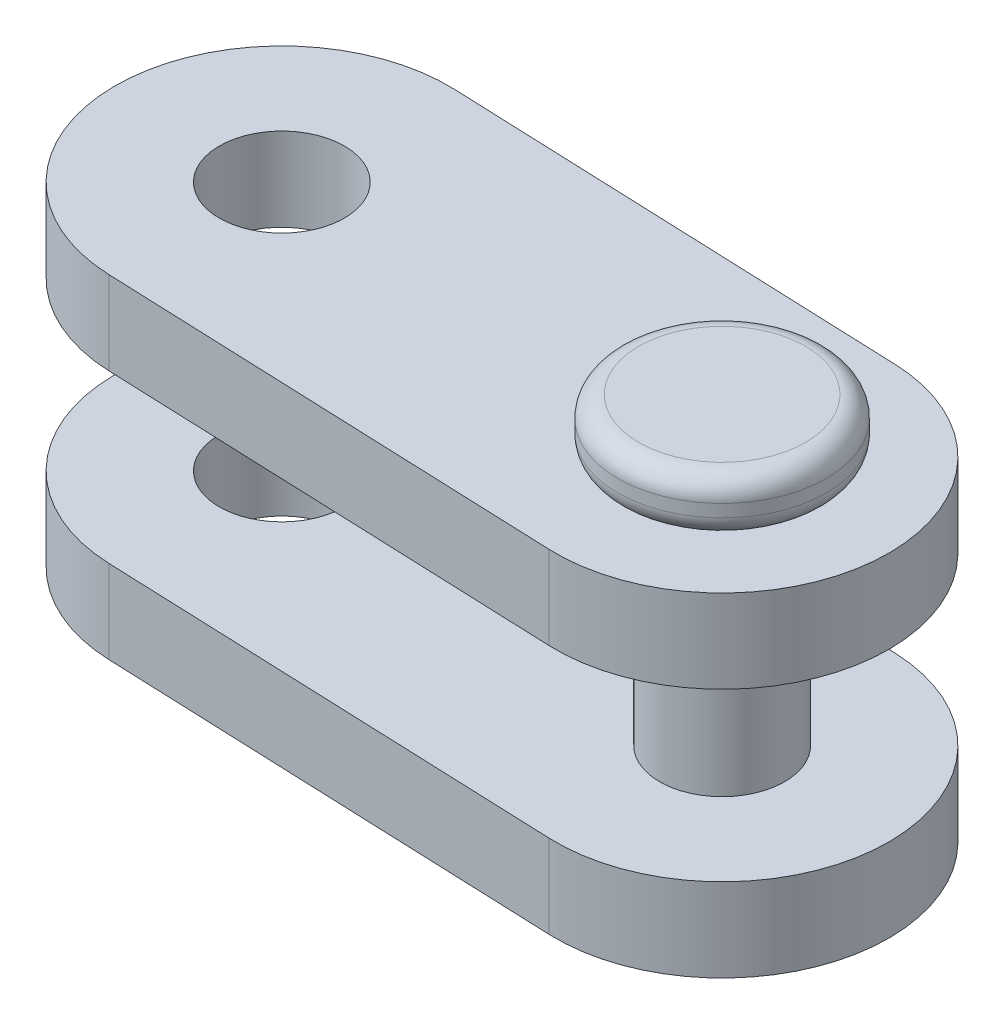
ISO-10303-21;
HEADER;
FILE_DESCRIPTION(('STEP AP214'),'2;1');
FILE_NAME('part.step','',(''),(''),'','','');
FILE_SCHEMA(('AUTOMOTIVE_DESIGN { 1 0 10303 214 1 1 1 1 }'));
ENDSEC;
DATA;
#1=APPLICATION_CONTEXT('core data for automotive mechanical design processes');
#2=APPLICATION_PROTOCOL_DEFINITION('international standard','automotive_design',2000,#1);
#3=PRODUCT_CONTEXT('',#1,'mechanical');
#4=PRODUCT('Part','Part','',(#3));
#5=PRODUCT_RELATED_PRODUCT_CATEGORY('part','',(#4));
#6=PRODUCT_DEFINITION_FORMATION('','',#4);
#7=PRODUCT_DEFINITION_CONTEXT('part definition',#1,'design');
#8=PRODUCT_DEFINITION('design','',#6,#7);
#9=PRODUCT_DEFINITION_SHAPE('','',#8);
#10=(LENGTH_UNIT() NAMED_UNIT(*) SI_UNIT(.MILLI.,.METRE.));
#11=(NAMED_UNIT(*) PLANE_ANGLE_UNIT() SI_UNIT($,.RADIAN.));
#12=(NAMED_UNIT(*) SI_UNIT($,.STERADIAN.) SOLID_ANGLE_UNIT());
#13=UNCERTAINTY_MEASURE_WITH_UNIT(LENGTH_MEASURE(1.E-05),#10,'distance_accuracy_value','');
#14=(GEOMETRIC_REPRESENTATION_CONTEXT(3) GLOBAL_UNCERTAINTY_ASSIGNED_CONTEXT((#13)) GLOBAL_UNIT_ASSIGNED_CONTEXT((#10,
#11,#12)) REPRESENTATION_CONTEXT('',''));
#15=CARTESIAN_POINT('',(0.,0.,0.));
#16=DIRECTION('',(0.,0.,1.));
#17=DIRECTION('',(1.,0.,0.));
#18=AXIS2_PLACEMENT_3D('',#15,#16,#17);
#19=CARTESIAN_POINT('',(0.,-4.00000000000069,0.));
#20=DIRECTION('',(0.,1.,0.));
#21=DIRECTION('',(-0.34082035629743,0.,0.940128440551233));
#22=AXIS2_PLACEMENT_3D('',#19,#20,#21);
#23=CYLINDRICAL_SURFACE('',#22,1.5);
#24=CARTESIAN_POINT('',(9.5062846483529E-13,-1.99999999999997,-6.00214322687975E-13));
#25=DIRECTION('',(0.,-1.,0.));
#26=DIRECTION('',(0.999207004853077,0.,0.0398165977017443));
#27=AXIS2_PLACEMENT_3D('',#24,#25,#26);
#28=CIRCLE('',#27,1.50000000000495);
#29=CARTESIAN_POINT('',(1.49881050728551,-1.99999999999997,0.0597248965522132));
#30=VERTEX_POINT('',#29);
#31=EDGE_CURVE('E26',#30,#30,#28,.F.);
#32=ORIENTED_EDGE('',*,*,#31,.T.);
#33=EDGE_LOOP('',(#32));
#34=FACE_BOUND('',#33,.T.);
#35=CARTESIAN_POINT('',(9.99200722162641E-13,2.00000000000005,-6.00214322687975E-13));
#36=DIRECTION('',(0.,-1.,0.));
#37=DIRECTION('',(0.999207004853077,0.,0.0398165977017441));
#38=AXIS2_PLACEMENT_3D('',#35,#36,#37);
#39=CIRCLE('',#38,1.50000000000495);
#40=CARTESIAN_POINT('',(1.49881050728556,2.00000000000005,0.0597248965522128));
#41=VERTEX_POINT('',#40);
#42=EDGE_CURVE('E9',#41,#41,#39,.T.);
#43=ORIENTED_EDGE('',*,*,#42,.T.);
#44=EDGE_LOOP('',(#43));
#45=FACE_BOUND('',#44,.T.);
#46=ADVANCED_FACE('F14',(#34,#45),#23,.T.);
#47=CARTESIAN_POINT('',(0.,5.29999999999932,0.));
#48=DIRECTION('',(0.,-1.,0.));
#49=DIRECTION('',(0.34082035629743,0.,-0.940128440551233));
#50=AXIS2_PLACEMENT_3D('',#47,#48,#49);
#51=PLANE('',#50);
#52=CARTESIAN_POINT('',(0.,5.29999999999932,0.));
#53=DIRECTION('',(0.,-1.,0.));
#54=DIRECTION('',(0.340820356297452,0.,-0.940128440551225));
#55=AXIS2_PLACEMENT_3D('',#52,#53,#54);
#56=CIRCLE('',#55,2.);
#57=CARTESIAN_POINT('',(0.681640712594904,5.29999999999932,-1.88025688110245));
#58=VERTEX_POINT('',#57);
#59=CARTESIAN_POINT('',(-0.681640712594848,5.29999999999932,1.88025688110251));
#60=VERTEX_POINT('',#59);
#61=EDGE_CURVE('E269',#58,#60,#56,.T.);
#62=ORIENTED_EDGE('',*,*,#61,.F.);
#63=CARTESIAN_POINT('',(0.,5.29999999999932,0.));
#64=DIRECTION('',(0.,-1.,0.));
#65=DIRECTION('',(-0.340820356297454,0.,0.940128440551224));
#66=AXIS2_PLACEMENT_3D('',#63,#64,#65);
#67=CIRCLE('',#66,2.);
#68=EDGE_CURVE('E265',#60,#58,#67,.T.);
#69=ORIENTED_EDGE('',*,*,#68,.F.);
#70=EDGE_LOOP('',(#62,#69));
#71=FACE_BOUND('',#70,.T.);
#72=ADVANCED_FACE('F189',(#71),#51,.F.);
#73=CARTESIAN_POINT('',(0.,4.79999999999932,0.));
#74=DIRECTION('',(0.,-1.,0.));
#75=DIRECTION('',(0.340820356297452,0.,-0.940128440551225));
#76=AXIS2_PLACEMENT_3D('',#73,#74,#75);
#77=TOROIDAL_SURFACE('',#76,2.,0.5);
#78=ORIENTED_EDGE('',*,*,#61,.T.);
#79=ORIENTED_EDGE('',*,*,#68,.T.);
#80=EDGE_LOOP('',(#78,#79));
#81=FACE_BOUND('',#80,.T.);
#82=CARTESIAN_POINT('',(0.,4.79999999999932,0.));
#83=DIRECTION('',(0.,1.,0.));
#84=DIRECTION('',(-0.34082035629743,0.,0.940128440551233));
#85=AXIS2_PLACEMENT_3D('',#82,#83,#84);
#86=CIRCLE('',#85,2.5);
#87=CARTESIAN_POINT('',(-0.852050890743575,4.79999999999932,2.35032110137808));
#88=VERTEX_POINT('',#87);
#89=EDGE_CURVE('E261',#88,#88,#86,.F.);
#90=ORIENTED_EDGE('',*,*,#89,.F.);
#91=EDGE_LOOP('',(#90));
#92=FACE_BOUND('',#91,.T.);
#93=ADVANCED_FACE('F253',(#81,#92),#77,.T.);
#94=CARTESIAN_POINT('',(0.,3.99999999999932,0.));
#95=DIRECTION('',(0.,1.,0.));
#96=DIRECTION('',(-0.34082035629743,0.,0.940128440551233));
#97=AXIS2_PLACEMENT_3D('',#94,#95,#96);
#98=CYLINDRICAL_SURFACE('',#97,2.5);
#99=CARTESIAN_POINT('',(0.,4.49999999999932,0.));
#100=DIRECTION('',(0.,-1.,0.));
#101=DIRECTION('',(0.34082035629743,0.,-0.940128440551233));
#102=AXIS2_PLACEMENT_3D('',#99,#100,#101);
#103=CIRCLE('',#102,2.5);
#104=CARTESIAN_POINT('',(0.852050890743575,4.49999999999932,-2.35032110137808));
#105=VERTEX_POINT('',#104);
#106=EDGE_CURVE('E534',#105,#105,#103,.T.);
#107=ORIENTED_EDGE('',*,*,#106,.F.);
#108=EDGE_LOOP('',(#107));
#109=FACE_BOUND('',#108,.T.);
#110=ORIENTED_EDGE('',*,*,#89,.T.);
#111=EDGE_LOOP('',(#110));
#112=FACE_BOUND('',#111,.T.);
#113=ADVANCED_FACE('F487',(#109,#112),#98,.T.);
#114=CARTESIAN_POINT('',(0.,4.49999999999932,0.));
#115=DIRECTION('',(0.,-1.,0.));
#116=DIRECTION('',(0.340820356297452,0.,-0.940128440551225));
#117=AXIS2_PLACEMENT_3D('',#114,#115,#116);
#118=TOROIDAL_SURFACE('',#117,2.,0.5);
#119=ORIENTED_EDGE('',*,*,#106,.T.);
#120=EDGE_LOOP('',(#119));
#121=FACE_BOUND('',#120,.T.);
#122=CARTESIAN_POINT('',(0.,3.99999999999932,0.));
#123=DIRECTION('',(0.,1.,0.));
#124=DIRECTION('',(0.340820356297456,0.,-0.940128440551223));
#125=AXIS2_PLACEMENT_3D('',#122,#123,#124);
#126=CIRCLE('',#125,2.);
#127=CARTESIAN_POINT('',(-0.681640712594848,3.99999999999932,1.88025688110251));
#128=VERTEX_POINT('',#127);
#129=CARTESIAN_POINT('',(0.681640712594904,3.99999999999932,-1.88025688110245));
#130=VERTEX_POINT('',#129);
#131=EDGE_CURVE('E34',#128,#130,#126,.F.);
#132=ORIENTED_EDGE('',*,*,#131,.F.);
#133=CARTESIAN_POINT('',(0.,3.99999999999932,0.));
#134=DIRECTION('',(0.,1.,0.));
#135=DIRECTION('',(-0.340820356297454,0.,0.940128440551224));
#136=AXIS2_PLACEMENT_3D('',#133,#134,#135);
#137=CIRCLE('',#136,2.);
#138=EDGE_CURVE('E614',#130,#128,#137,.F.);
#139=ORIENTED_EDGE('',*,*,#138,.F.);
#140=EDGE_LOOP('',(#132,#139));
#141=FACE_BOUND('',#140,.T.);
#142=ADVANCED_FACE('F215',(#121,#141),#118,.T.);
#143=CARTESIAN_POINT('',(0.,-5.30000000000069,0.));
#144=DIRECTION('',(0.,1.,0.));
#145=DIRECTION('',(-0.34082035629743,0.,0.940128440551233));
#146=AXIS2_PLACEMENT_3D('',#143,#144,#145);
#147=PLANE('',#146);
#148=CARTESIAN_POINT('',(0.,-5.30000000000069,0.));
#149=DIRECTION('',(0.,1.,0.));
#150=DIRECTION('',(-0.340820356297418,0.,0.940128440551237));
#151=AXIS2_PLACEMENT_3D('',#148,#149,#150);
#152=CIRCLE('',#151,2.00000000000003);
#153=CARTESIAN_POINT('',(-0.681640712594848,-5.30000000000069,1.88025688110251));
#154=VERTEX_POINT('',#153);
#155=CARTESIAN_POINT('',(0.681640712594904,-5.30000000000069,-1.88025688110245));
#156=VERTEX_POINT('',#155);
#157=EDGE_CURVE('E297',#154,#156,#152,.T.);
#158=ORIENTED_EDGE('',*,*,#157,.F.);
#159=CARTESIAN_POINT('',(0.,-5.30000000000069,0.));
#160=DIRECTION('',(0.,1.,0.));
#161=DIRECTION('',(0.340820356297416,0.,-0.940128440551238));
#162=AXIS2_PLACEMENT_3D('',#159,#160,#161);
#163=CIRCLE('',#162,2.00000000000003);
#164=EDGE_CURVE('E238',#156,#154,#163,.T.);
#165=ORIENTED_EDGE('',*,*,#164,.F.);
#166=EDGE_LOOP('',(#158,#165));
#167=FACE_BOUND('',#166,.T.);
#168=ADVANCED_FACE('F210',(#167),#147,.F.);
#169=CARTESIAN_POINT('',(0.,-4.80000000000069,0.));
#170=DIRECTION('',(0.,1.,0.));
#171=DIRECTION('',(-0.340820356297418,0.,0.940128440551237));
#172=AXIS2_PLACEMENT_3D('',#169,#170,#171);
#173=TOROIDAL_SURFACE('',#172,2.00000000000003,0.5);
#174=ORIENTED_EDGE('',*,*,#157,.T.);
#175=ORIENTED_EDGE('',*,*,#164,.T.);
#176=EDGE_LOOP('',(#174,#175));
#177=FACE_BOUND('',#176,.T.);
#178=CARTESIAN_POINT('',(0.,-4.80000000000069,0.));
#179=DIRECTION('',(0.,-1.,0.));
#180=DIRECTION('',(0.34082035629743,0.,-0.940128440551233));
#181=AXIS2_PLACEMENT_3D('',#178,#179,#180);
#182=CIRCLE('',#181,2.5);
#183=CARTESIAN_POINT('',(0.852050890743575,-4.80000000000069,-2.35032110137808));
#184=VERTEX_POINT('',#183);
#185=EDGE_CURVE('E262',#184,#184,#182,.F.);
#186=ORIENTED_EDGE('',*,*,#185,.F.);
#187=EDGE_LOOP('',(#186));
#188=FACE_BOUND('',#187,.T.);
#189=ADVANCED_FACE('F214',(#177,#188),#173,.T.);
#190=CARTESIAN_POINT('',(0.,-4.00000000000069,0.));
#191=DIRECTION('',(0.,-1.,0.));
#192=DIRECTION('',(0.34082035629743,0.,-0.940128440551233));
#193=AXIS2_PLACEMENT_3D('',#190,#191,#192);
#194=CYLINDRICAL_SURFACE('',#193,2.5);
#195=CARTESIAN_POINT('',(0.,-4.50000000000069,0.));
#196=DIRECTION('',(0.,1.,0.));
#197=DIRECTION('',(-0.34082035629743,0.,0.940128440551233));
#198=AXIS2_PLACEMENT_3D('',#195,#196,#197);
#199=CIRCLE('',#198,2.5);
#200=CARTESIAN_POINT('',(-0.852050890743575,-4.50000000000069,2.35032110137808));
#201=VERTEX_POINT('',#200);
#202=EDGE_CURVE('E532',#201,#201,#199,.T.);
#203=ORIENTED_EDGE('',*,*,#202,.F.);
#204=EDGE_LOOP('',(#203));
#205=FACE_BOUND('',#204,.T.);
#206=ORIENTED_EDGE('',*,*,#185,.T.);
#207=EDGE_LOOP('',(#206));
#208=FACE_BOUND('',#207,.T.);
#209=ADVANCED_FACE('F252',(#205,#208),#194,.T.);
#210=CARTESIAN_POINT('',(0.,-4.50000000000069,0.));
#211=DIRECTION('',(0.,1.,0.));
#212=DIRECTION('',(-0.340820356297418,0.,0.940128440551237));
#213=AXIS2_PLACEMENT_3D('',#210,#211,#212);
#214=TOROIDAL_SURFACE('',#213,2.00000000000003,0.5);
#215=ORIENTED_EDGE('',*,*,#202,.T.);
#216=EDGE_LOOP('',(#215));
#217=FACE_BOUND('',#216,.T.);
#218=CARTESIAN_POINT('',(0.,-4.00000000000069,0.));
#219=DIRECTION('',(0.,-1.,0.));
#220=DIRECTION('',(-0.340820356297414,0.,0.940128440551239));
#221=AXIS2_PLACEMENT_3D('',#218,#219,#220);
#222=CIRCLE('',#221,2.00000000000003);
#223=CARTESIAN_POINT('',(0.681640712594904,-4.00000000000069,-1.88025688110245));
#224=VERTEX_POINT('',#223);
#225=CARTESIAN_POINT('',(-0.681640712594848,-4.00000000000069,1.88025688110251));
#226=VERTEX_POINT('',#225);
#227=EDGE_CURVE('E145',#224,#226,#222,.F.);
#228=ORIENTED_EDGE('',*,*,#227,.F.);
#229=CARTESIAN_POINT('',(0.,-4.00000000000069,0.));
#230=DIRECTION('',(0.,-1.,0.));
#231=DIRECTION('',(0.340820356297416,0.,-0.940128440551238));
#232=AXIS2_PLACEMENT_3D('',#229,#230,#231);
#233=CIRCLE('',#232,2.00000000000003);
#234=EDGE_CURVE('E538',#226,#224,#233,.F.);
#235=ORIENTED_EDGE('',*,*,#234,.F.);
#236=EDGE_LOOP('',(#228,#235));
#237=FACE_BOUND('',#236,.T.);
#238=ADVANCED_FACE('F460',(#217,#237),#214,.T.);
#239=CARTESIAN_POINT('',(-10.991642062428,2.00000000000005,-0.428724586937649));
#240=DIRECTION('',(0.,-1.,0.));
#241=DIRECTION('',(0.999207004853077,0.,0.0398165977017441));
#242=AXIS2_PLACEMENT_3D('',#239,#240,#241);
#243=CYLINDRICAL_SURFACE('',#242,1.49999999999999);
#244=CARTESIAN_POINT('',(-10.991642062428,2.00000000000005,-0.428724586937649));
#245=DIRECTION('',(0.,-1.,0.));
#246=DIRECTION('',(0.999207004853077,0.,0.0398165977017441));
#247=AXIS2_PLACEMENT_3D('',#244,#245,#246);
#248=CIRCLE('',#247,1.500000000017);
#249=CARTESIAN_POINT('',(-9.4928315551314,2.00000000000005,-0.368999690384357));
#250=VERTEX_POINT('',#249);
#251=EDGE_CURVE('E345',#250,#250,#248,.T.);
#252=ORIENTED_EDGE('',*,*,#251,.T.);
#253=EDGE_LOOP('',(#252));
#254=FACE_BOUND('',#253,.T.);
#255=CARTESIAN_POINT('',(-10.991642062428,4.,-0.428724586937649));
#256=DIRECTION('',(0.,-1.,0.));
#257=DIRECTION('',(0.999207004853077,0.,0.0398165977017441));
#258=AXIS2_PLACEMENT_3D('',#255,#256,#257);
#259=CIRCLE('',#258,1.500000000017);
#260=CARTESIAN_POINT('',(-9.4928315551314,4.,-0.368999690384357));
#261=VERTEX_POINT('',#260);
#262=EDGE_CURVE('E309',#261,#261,#259,.F.);
#263=ORIENTED_EDGE('',*,*,#262,.T.);
#264=EDGE_LOOP('',(#263));
#265=FACE_BOUND('',#264,.T.);
#266=ADVANCED_FACE('F162',(#254,#265),#243,.F.);
#267=CARTESIAN_POINT('',(-10.8357422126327,2.00000000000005,-4.4256853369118));
#268=DIRECTION('',(-0.038974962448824,0.,0.999240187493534));
#269=DIRECTION('',(-0.999240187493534,0.,-0.038974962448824));
#270=AXIS2_PLACEMENT_3D('',#267,#268,#269);
#271=PLANE('',#270);
#272=DIRECTION('',(0.,1.,0.));
#273=VECTOR('',#272,1.);
#274=CARTESIAN_POINT('',(0.155899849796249,2.00000000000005,-3.9969607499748));
#275=LINE('',#274,#273);
#276=CARTESIAN_POINT('',(0.155899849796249,2.00000000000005,-3.99696074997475));
#277=VERTEX_POINT('',#276);
#278=CARTESIAN_POINT('',(0.155899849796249,4.00000000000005,-3.99696074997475));
#279=VERTEX_POINT('',#278);
#280=EDGE_CURVE('E317',#277,#279,#275,.T.);
#281=ORIENTED_EDGE('',*,*,#280,.F.);
#282=DIRECTION('',(0.999240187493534,0.,0.038974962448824));
#283=VECTOR('',#282,1.);
#284=CARTESIAN_POINT('',(-10.8357422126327,2.00000000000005,-4.4256853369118));
#285=LINE('',#284,#283);
#286=CARTESIAN_POINT('',(-10.8357422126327,2.00000000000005,-4.4256853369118));
#287=VERTEX_POINT('',#286);
#288=EDGE_CURVE('E305',#287,#277,#285,.T.);
#289=ORIENTED_EDGE('',*,*,#288,.F.);
#290=DIRECTION('',(0.,-1.,0.));
#291=VECTOR('',#290,1.);
#292=CARTESIAN_POINT('',(-10.8357422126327,2.00000000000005,-4.4256853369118));
#293=LINE('',#292,#291);
#294=CARTESIAN_POINT('',(-10.8357422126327,4.,-4.4256853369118));
#295=VERTEX_POINT('',#294);
#296=EDGE_CURVE('E324',#295,#287,#293,.T.);
#297=ORIENTED_EDGE('',*,*,#296,.F.);
#298=DIRECTION('',(-0.999240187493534,0.,-0.038974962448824));
#299=VECTOR('',#298,1.);
#300=CARTESIAN_POINT('',(-10.8357422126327,4.,-4.4256853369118));
#301=LINE('',#300,#299);
#302=EDGE_CURVE('E327',#279,#295,#301,.T.);
#303=ORIENTED_EDGE('',*,*,#302,.F.);
#304=EDGE_LOOP('',(#281,#289,#297,#303));
#305=FACE_BOUND('',#304,.T.);
#306=ADVANCED_FACE('F195',(#305),#271,.F.);
#307=CARTESIAN_POINT('',(-10.991642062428,2.00000000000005,-0.428724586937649));
#308=DIRECTION('',(0.,1.,0.));
#309=DIRECTION('',(-0.999207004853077,0.,-0.0398165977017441));
#310=AXIS2_PLACEMENT_3D('',#307,#308,#309);
#311=CYLINDRICAL_SURFACE('',#310,4.);
#312=CARTESIAN_POINT('',(-10.991642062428,4.,-0.428724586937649));
#313=DIRECTION('',(0.,1.,0.));
#314=DIRECTION('',(-0.999207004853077,0.,-0.0398165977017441));
#315=AXIS2_PLACEMENT_3D('',#312,#313,#314);
#316=CIRCLE('',#315,4.);
#317=CARTESIAN_POINT('',(-11.1475419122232,4.,3.56823616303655));
#318=VERTEX_POINT('',#317);
#319=EDGE_CURVE('E328',#318,#295,#316,.F.);
#320=ORIENTED_EDGE('',*,*,#319,.T.);
#321=ORIENTED_EDGE('',*,*,#296,.T.);
#322=CARTESIAN_POINT('',(-10.991642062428,2.00000000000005,-0.428724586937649));
#323=DIRECTION('',(0.,1.,0.));
#324=DIRECTION('',(-0.999207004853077,0.,-0.0398165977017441));
#325=AXIS2_PLACEMENT_3D('',#322,#323,#324);
#326=CIRCLE('',#325,4.);
#327=CARTESIAN_POINT('',(-11.1475419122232,2.00000000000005,3.56823616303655));
#328=VERTEX_POINT('',#327);
#329=EDGE_CURVE('E313',#328,#287,#326,.F.);
#330=ORIENTED_EDGE('',*,*,#329,.F.);
#331=DIRECTION('',(0.,-1.,0.));
#332=VECTOR('',#331,1.);
#333=CARTESIAN_POINT('',(-11.1475419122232,2.00000000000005,3.56823616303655));
#334=LINE('',#333,#332);
#335=EDGE_CURVE('E316',#328,#318,#334,.F.);
#336=ORIENTED_EDGE('',*,*,#335,.T.);
#337=EDGE_LOOP('',(#320,#321,#330,#336));
#338=FACE_BOUND('',#337,.T.);
#339=ADVANCED_FACE('F190',(#338),#311,.T.);
#340=CARTESIAN_POINT('',(-11.1475419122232,2.00000000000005,3.56823616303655));
#341=DIRECTION('',(0.038974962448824,0.,-0.999240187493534));
#342=DIRECTION('',(0.999240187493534,0.,0.038974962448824));
#343=AXIS2_PLACEMENT_3D('',#340,#341,#342);
#344=PLANE('',#343);
#345=ORIENTED_EDGE('',*,*,#335,.F.);
#346=DIRECTION('',(-0.999240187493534,0.,-0.0389749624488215));
#347=VECTOR('',#346,1.);
#348=CARTESIAN_POINT('',(-0.155899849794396,2.00000000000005,3.99696074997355));
#349=LINE('',#348,#347);
#350=CARTESIAN_POINT('',(-0.155899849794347,2.00000000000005,3.9969607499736));
#351=VERTEX_POINT('',#350);
#352=EDGE_CURVE('E299',#351,#328,#349,.T.);
#353=ORIENTED_EDGE('',*,*,#352,.F.);
#354=DIRECTION('',(0.,-1.,0.));
#355=VECTOR('',#354,1.);
#356=CARTESIAN_POINT('',(-0.155899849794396,2.00000000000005,3.9969607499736));
#357=LINE('',#356,#355);
#358=CARTESIAN_POINT('',(-0.155899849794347,4.00000000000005,3.9969607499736));
#359=VERTEX_POINT('',#358);
#360=EDGE_CURVE('E314',#359,#351,#357,.T.);
#361=ORIENTED_EDGE('',*,*,#360,.F.);
#362=DIRECTION('',(0.999240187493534,0.,0.038974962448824));
#363=VECTOR('',#362,1.);
#364=CARTESIAN_POINT('',(-11.1475419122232,4.00000000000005,3.56823616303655));
#365=LINE('',#364,#363);
#366=EDGE_CURVE('E320',#318,#359,#365,.T.);
#367=ORIENTED_EDGE('',*,*,#366,.F.);
#368=EDGE_LOOP('',(#345,#353,#361,#367));
#369=FACE_BOUND('',#368,.T.);
#370=ADVANCED_FACE('F194',(#369),#344,.F.);
#371=CARTESIAN_POINT('',(9.99200722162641E-13,2.00000000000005,-6.00214322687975E-13));
#372=DIRECTION('',(0.,1.,0.));
#373=DIRECTION('',(-0.999207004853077,0.,-0.0398165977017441));
#374=AXIS2_PLACEMENT_3D('',#371,#372,#373);
#375=CYLINDRICAL_SURFACE('',#374,4.00000000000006);
#376=CARTESIAN_POINT('',(9.99200722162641E-13,2.00000000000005,-6.00214322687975E-13));
#377=DIRECTION('',(0.,1.,0.));
#378=DIRECTION('',(-0.999207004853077,0.,-0.0398165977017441));
#379=AXIS2_PLACEMENT_3D('',#376,#377,#378);
#380=CIRCLE('',#379,4.00000000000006);
#381=EDGE_CURVE('E301',#277,#351,#380,.F.);
#382=ORIENTED_EDGE('',*,*,#381,.F.);
#383=ORIENTED_EDGE('',*,*,#280,.T.);
#384=CARTESIAN_POINT('',(9.99200722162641E-13,4.00000000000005,-6.00214322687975E-13));
#385=DIRECTION('',(0.,1.,0.));
#386=DIRECTION('',(-0.999207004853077,0.,-0.0398165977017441));
#387=AXIS2_PLACEMENT_3D('',#384,#385,#386);
#388=CIRCLE('',#387,4.00000000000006);
#389=EDGE_CURVE('E323',#279,#359,#388,.F.);
#390=ORIENTED_EDGE('',*,*,#389,.T.);
#391=ORIENTED_EDGE('',*,*,#360,.T.);
#392=EDGE_LOOP('',(#382,#383,#390,#391));
#393=FACE_BOUND('',#392,.T.);
#394=ADVANCED_FACE('F200',(#393),#375,.T.);
#395=CARTESIAN_POINT('',(-10.991642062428,2.00000000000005,-0.428724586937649));
#396=DIRECTION('',(0.,-1.,0.));
#397=DIRECTION('',(0.999207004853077,0.,0.0398165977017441));
#398=AXIS2_PLACEMENT_3D('',#395,#396,#397);
#399=PLANE('',#398);
#400=ORIENTED_EDGE('',*,*,#381,.T.);
#401=ORIENTED_EDGE('',*,*,#352,.T.);
#402=ORIENTED_EDGE('',*,*,#329,.T.);
#403=ORIENTED_EDGE('',*,*,#288,.T.);
#404=EDGE_LOOP('',(#400,#401,#402,#403));
#405=FACE_BOUND('',#404,.T.);
#406=ORIENTED_EDGE('',*,*,#251,.F.);
#407=EDGE_LOOP('',(#406));
#408=FACE_BOUND('',#407,.T.);
#409=ORIENTED_EDGE('',*,*,#42,.F.);
#410=EDGE_LOOP('',(#409));
#411=FACE_BOUND('',#410,.T.);
#412=ADVANCED_FACE('F187',(#405,#408,#411),#399,.T.);
#413=CARTESIAN_POINT('',(-10.991642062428,4.,-0.428724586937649));
#414=DIRECTION('',(0.,-1.,0.));
#415=DIRECTION('',(0.999207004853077,0.,0.0398165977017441));
#416=AXIS2_PLACEMENT_3D('',#413,#414,#415);
#417=PLANE('',#416);
#418=ORIENTED_EDGE('',*,*,#262,.F.);
#419=EDGE_LOOP('',(#418));
#420=FACE_BOUND('',#419,.T.);
#421=ORIENTED_EDGE('',*,*,#366,.T.);
#422=ORIENTED_EDGE('',*,*,#389,.F.);
#423=ORIENTED_EDGE('',*,*,#302,.T.);
#424=ORIENTED_EDGE('',*,*,#319,.F.);
#425=EDGE_LOOP('',(#421,#422,#423,#424));
#426=FACE_BOUND('',#425,.T.);
#427=ORIENTED_EDGE('',*,*,#131,.T.);
#428=ORIENTED_EDGE('',*,*,#138,.T.);
#429=EDGE_LOOP('',(#427,#428));
#430=FACE_BOUND('',#429,.T.);
#431=ADVANCED_FACE('F178',(#420,#426,#430),#417,.F.);
#432=CARTESIAN_POINT('',(-10.991642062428,-4.,-0.428724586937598));
#433=DIRECTION('',(0.,-1.,0.));
#434=DIRECTION('',(0.999207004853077,0.,0.0398165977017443));
#435=AXIS2_PLACEMENT_3D('',#432,#433,#434);
#436=CYLINDRICAL_SURFACE('',#435,1.49999999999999);
#437=CARTESIAN_POINT('',(-10.991642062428,-4.,-0.428724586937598));
#438=DIRECTION('',(0.,-1.,0.));
#439=DIRECTION('',(0.999207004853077,0.,0.0398165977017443));
#440=AXIS2_PLACEMENT_3D('',#437,#438,#439);
#441=CIRCLE('',#440,1.500000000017);
#442=CARTESIAN_POINT('',(-9.4928315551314,-4.,-0.368999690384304));
#443=VERTEX_POINT('',#442);
#444=EDGE_CURVE('E338',#443,#443,#441,.T.);
#445=ORIENTED_EDGE('',*,*,#444,.T.);
#446=EDGE_LOOP('',(#445));
#447=FACE_BOUND('',#446,.T.);
#448=CARTESIAN_POINT('',(-10.991642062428,-2.,-0.428724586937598));
#449=DIRECTION('',(0.,-1.,0.));
#450=DIRECTION('',(0.999207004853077,0.,0.0398165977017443));
#451=AXIS2_PLACEMENT_3D('',#448,#449,#450);
#452=CIRCLE('',#451,1.500000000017);
#453=CARTESIAN_POINT('',(-9.4928315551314,-2.,-0.368999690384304));
#454=VERTEX_POINT('',#453);
#455=EDGE_CURVE('E115',#454,#454,#452,.F.);
#456=ORIENTED_EDGE('',*,*,#455,.T.);
#457=EDGE_LOOP('',(#456));
#458=FACE_BOUND('',#457,.T.);
#459=ADVANCED_FACE('F16',(#447,#458),#436,.F.);
#460=CARTESIAN_POINT('',(-10.991642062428,-4.,-0.428724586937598));
#461=DIRECTION('',(0.,1.,0.));
#462=DIRECTION('',(-0.999207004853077,0.,-0.0398165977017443));
#463=AXIS2_PLACEMENT_3D('',#460,#461,#462);
#464=CYLINDRICAL_SURFACE('',#463,4.);
#465=CARTESIAN_POINT('',(-10.991642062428,-2.,-0.428724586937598));
#466=DIRECTION('',(0.,1.,0.));
#467=DIRECTION('',(-0.999207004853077,0.,-0.0398165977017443));
#468=AXIS2_PLACEMENT_3D('',#465,#466,#467);
#469=CIRCLE('',#468,4.);
#470=CARTESIAN_POINT('',(-11.1475419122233,-2.,3.56823616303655));
#471=VERTEX_POINT('',#470);
#472=CARTESIAN_POINT('',(-10.8357422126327,-2.,-4.4256853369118));
#473=VERTEX_POINT('',#472);
#474=EDGE_CURVE('E104',#471,#473,#469,.F.);
#475=ORIENTED_EDGE('',*,*,#474,.T.);
#476=DIRECTION('',(0.,-1.,0.));
#477=VECTOR('',#476,1.);
#478=CARTESIAN_POINT('',(-10.8357422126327,-4.,-4.4256853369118));
#479=LINE('',#478,#477);
#480=CARTESIAN_POINT('',(-10.8357422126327,-4.,-4.4256853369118));
#481=VERTEX_POINT('',#480);
#482=EDGE_CURVE('E108',#473,#481,#479,.T.);
#483=ORIENTED_EDGE('',*,*,#482,.T.);
#484=CARTESIAN_POINT('',(-10.991642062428,-4.,-0.428724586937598));
#485=DIRECTION('',(0.,1.,0.));
#486=DIRECTION('',(-0.999207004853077,0.,-0.0398165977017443));
#487=AXIS2_PLACEMENT_3D('',#484,#485,#486);
#488=CIRCLE('',#487,4.);
#489=CARTESIAN_POINT('',(-11.1475419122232,-4.,3.56823616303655));
#490=VERTEX_POINT('',#489);
#491=EDGE_CURVE('E134',#490,#481,#488,.F.);
#492=ORIENTED_EDGE('',*,*,#491,.F.);
#493=DIRECTION('',(0.,-1.,0.));
#494=VECTOR('',#493,1.);
#495=CARTESIAN_POINT('',(-11.1475419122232,-4.,3.56823616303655));
#496=LINE('',#495,#494);
#497=EDGE_CURVE('E111',#490,#471,#496,.F.);
#498=ORIENTED_EDGE('',*,*,#497,.T.);
#499=EDGE_LOOP('',(#475,#483,#492,#498));
#500=FACE_BOUND('',#499,.T.);
#501=ADVANCED_FACE('F106',(#500),#464,.T.);
#502=CARTESIAN_POINT('',(-10.8357422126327,-4.,-4.4256853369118));
#503=DIRECTION('',(-0.0389749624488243,0.,0.999240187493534));
#504=DIRECTION('',(-0.999240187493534,0.,-0.0389749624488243));
#505=AXIS2_PLACEMENT_3D('',#502,#503,#504);
#506=PLANE('',#505);
#507=DIRECTION('',(0.,1.,0.));
#508=VECTOR('',#507,1.);
#509=CARTESIAN_POINT('',(0.155899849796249,-4.,-3.9969607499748));
#510=LINE('',#509,#508);
#511=CARTESIAN_POINT('',(0.155899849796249,-4.,-3.99696074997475));
#512=VERTEX_POINT('',#511);
#513=CARTESIAN_POINT('',(0.155899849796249,-2.,-3.99696074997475));
#514=VERTEX_POINT('',#513);
#515=EDGE_CURVE('E131',#512,#514,#510,.T.);
#516=ORIENTED_EDGE('',*,*,#515,.F.);
#517=DIRECTION('',(0.999240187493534,0.,0.0389749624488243));
#518=VECTOR('',#517,1.);
#519=CARTESIAN_POINT('',(-10.8357422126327,-4.,-4.4256853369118));
#520=LINE('',#519,#518);
#521=EDGE_CURVE('E127',#481,#512,#520,.T.);
#522=ORIENTED_EDGE('',*,*,#521,.F.);
#523=ORIENTED_EDGE('',*,*,#482,.F.);
#524=DIRECTION('',(-0.999240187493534,0.,-0.0389749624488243));
#525=VECTOR('',#524,1.);
#526=CARTESIAN_POINT('',(-10.8357422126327,-2.,-4.4256853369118));
#527=LINE('',#526,#525);
#528=EDGE_CURVE('E118',#514,#473,#527,.T.);
#529=ORIENTED_EDGE('',*,*,#528,.F.);
#530=EDGE_LOOP('',(#516,#522,#523,#529));
#531=FACE_BOUND('',#530,.T.);
#532=ADVANCED_FACE('F125',(#531),#506,.F.);
#533=CARTESIAN_POINT('',(9.5062846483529E-13,-4.,-6.00214322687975E-13));
#534=DIRECTION('',(0.,1.,0.));
#535=DIRECTION('',(-0.999207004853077,0.,-0.0398165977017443));
#536=AXIS2_PLACEMENT_3D('',#533,#534,#535);
#537=CYLINDRICAL_SURFACE('',#536,4.00000000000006);
#538=CARTESIAN_POINT('',(9.5062846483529E-13,-4.,-6.00214322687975E-13));
#539=DIRECTION('',(0.,1.,0.));
#540=DIRECTION('',(-0.999207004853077,0.,-0.0398165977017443));
#541=AXIS2_PLACEMENT_3D('',#538,#539,#540);
#542=CIRCLE('',#541,4.00000000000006);
#543=CARTESIAN_POINT('',(-0.155899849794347,-4.,3.9969607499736));
#544=VERTEX_POINT('',#543);
#545=EDGE_CURVE('E136',#512,#544,#542,.F.);
#546=ORIENTED_EDGE('',*,*,#545,.F.);
#547=ORIENTED_EDGE('',*,*,#515,.T.);
#548=CARTESIAN_POINT('',(9.5062846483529E-13,-1.99999999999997,-6.00214322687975E-13));
#549=DIRECTION('',(0.,1.,0.));
#550=DIRECTION('',(-0.999207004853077,0.,-0.0398165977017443));
#551=AXIS2_PLACEMENT_3D('',#548,#549,#550);
#552=CIRCLE('',#551,4.00000000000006);
#553=CARTESIAN_POINT('',(-0.155899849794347,-1.99999999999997,3.9969607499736));
#554=VERTEX_POINT('',#553);
#555=EDGE_CURVE('E121',#514,#554,#552,.F.);
#556=ORIENTED_EDGE('',*,*,#555,.T.);
#557=DIRECTION('',(0.,-1.,0.));
#558=VECTOR('',#557,1.);
#559=CARTESIAN_POINT('',(-0.155899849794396,-4.,3.9969607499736));
#560=LINE('',#559,#558);
#561=EDGE_CURVE('E347',#554,#544,#560,.T.);
#562=ORIENTED_EDGE('',*,*,#561,.T.);
#563=EDGE_LOOP('',(#546,#547,#556,#562));
#564=FACE_BOUND('',#563,.T.);
#565=ADVANCED_FACE('F352',(#564),#537,.T.);
#566=CARTESIAN_POINT('',(-11.1475419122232,-4.,3.56823616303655));
#567=DIRECTION('',(0.0389749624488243,0.,-0.999240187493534));
#568=DIRECTION('',(0.999240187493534,0.,0.0389749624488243));
#569=AXIS2_PLACEMENT_3D('',#566,#567,#568);
#570=PLANE('',#569);
#571=ORIENTED_EDGE('',*,*,#497,.F.);
#572=DIRECTION('',(-0.999240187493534,0.,-0.0389749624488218));
#573=VECTOR('',#572,1.);
#574=CARTESIAN_POINT('',(-0.155899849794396,-4.,3.9969607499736));
#575=LINE('',#574,#573);
#576=EDGE_CURVE('E139',#544,#490,#575,.T.);
#577=ORIENTED_EDGE('',*,*,#576,.F.);
#578=ORIENTED_EDGE('',*,*,#561,.F.);
#579=DIRECTION('',(0.999240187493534,0.,0.0389749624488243));
#580=VECTOR('',#579,1.);
#581=CARTESIAN_POINT('',(-11.1475419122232,-2.,3.56823616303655));
#582=LINE('',#581,#580);
#583=EDGE_CURVE('E133',#471,#554,#582,.T.);
#584=ORIENTED_EDGE('',*,*,#583,.F.);
#585=EDGE_LOOP('',(#571,#577,#578,#584));
#586=FACE_BOUND('',#585,.T.);
#587=ADVANCED_FACE('F163',(#586),#570,.F.);
#588=CARTESIAN_POINT('',(-10.991642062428,-2.,-0.428724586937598));
#589=DIRECTION('',(0.,-1.,0.));
#590=DIRECTION('',(0.999207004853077,0.,0.0398165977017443));
#591=AXIS2_PLACEMENT_3D('',#588,#589,#590);
#592=PLANE('',#591);
#593=ORIENTED_EDGE('',*,*,#583,.T.);
#594=ORIENTED_EDGE('',*,*,#555,.F.);
#595=ORIENTED_EDGE('',*,*,#528,.T.);
#596=ORIENTED_EDGE('',*,*,#474,.F.);
#597=EDGE_LOOP('',(#593,#594,#595,#596));
#598=FACE_BOUND('',#597,.T.);
#599=ORIENTED_EDGE('',*,*,#455,.F.);
#600=EDGE_LOOP('',(#599));
#601=FACE_BOUND('',#600,.T.);
#602=ORIENTED_EDGE('',*,*,#31,.F.);
#603=EDGE_LOOP('',(#602));
#604=FACE_BOUND('',#603,.T.);
#605=ADVANCED_FACE('F119',(#598,#601,#604),#592,.F.);
#606=CARTESIAN_POINT('',(-10.991642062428,-4.,-0.428724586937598));
#607=DIRECTION('',(0.,-1.,0.));
#608=DIRECTION('',(0.999207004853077,0.,0.0398165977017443));
#609=AXIS2_PLACEMENT_3D('',#606,#607,#608);
#610=PLANE('',#609);
#611=ORIENTED_EDGE('',*,*,#227,.T.);
#612=ORIENTED_EDGE('',*,*,#234,.T.);
#613=EDGE_LOOP('',(#611,#612));
#614=FACE_BOUND('',#613,.T.);
#615=ORIENTED_EDGE('',*,*,#545,.T.);
#616=ORIENTED_EDGE('',*,*,#576,.T.);
#617=ORIENTED_EDGE('',*,*,#491,.T.);
#618=ORIENTED_EDGE('',*,*,#521,.T.);
#619=EDGE_LOOP('',(#615,#616,#617,#618));
#620=FACE_BOUND('',#619,.T.);
#621=ORIENTED_EDGE('',*,*,#444,.F.);
#622=EDGE_LOOP('',(#621));
#623=FACE_BOUND('',#622,.T.);
#624=ADVANCED_FACE('F152',(#614,#620,#623),#610,.T.);
#625=CLOSED_SHELL('',(#46,#72,#93,#113,#142,#168,#189,#209,#238,#266,#306,#339,#370,#394,#412,
#431,#459,#501,#532,#565,#587,#605,#624));
#626=MANIFOLD_SOLID_BREP('B1',#625);
#627=ADVANCED_BREP_SHAPE_REPRESENTATION('',(#18,#626),#14);
#628=SHAPE_DEFINITION_REPRESENTATION(#9,#627);
ENDSEC;
END-ISO-10303-21;
